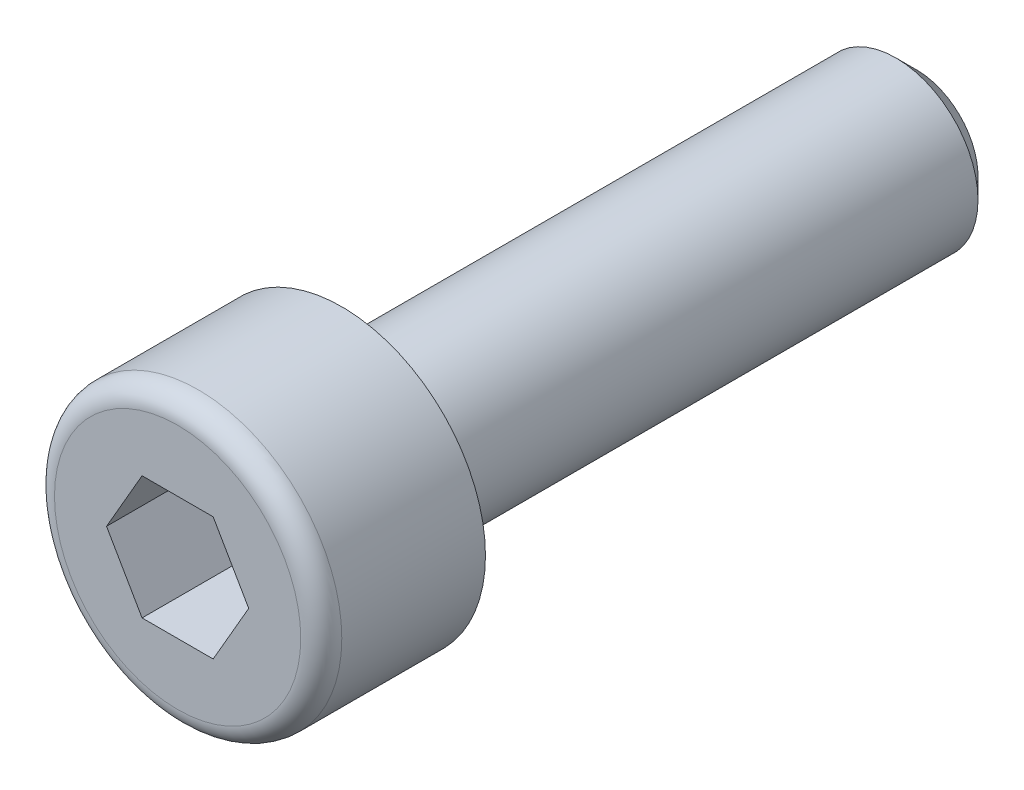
from build123d import *

# Parameters (mm, degrees)
ESQUISSE1_R             = 3.5
BASE_EXTRUSION_DEPTH    = 4
ESQUISSE2_R             = 2
BOSS_EXTRU_1_DEPTH      = 14
CHANFREIN1_SIZE         = 0.5
ENL_V_MAT_EXTRU_1_DEPTH = 3
CONG_1_R                = 0.5


with BuildPart() as part:
    # Esquisse1 → Base-Extrusion (new body)
    with BuildSketch(Plane.XY):
        Circle(ESQUISSE1_R)
    extrude(amount=BASE_EXTRUSION_DEPTH)

    # Esquisse2 → Boss.-Extru.1 (add)
    with BuildSketch(Plane(origin=(0, 0, 0), x_dir=(-1, 0, 0), z_dir=(0, 0, -1))):
        with Locations(Location((0, 0, 0), (0, 0, 180))):
            Circle(ESQUISSE2_R)
    extrude(amount=BOSS_EXTRU_1_DEPTH)

    # Chanfrein1
    chanfrein1_edges = [part.edges().sort_by_distance(p)[0] for p in [
        (-2, 0, -14),
    ]]
    chamfer(chanfrein1_edges, length=CHANFREIN1_SIZE)

    # Esquisse3 → Enl_v. mat.-Extru.1 (cut)
    with BuildSketch(Plane.XY.offset(4)):
        Polygon((1.732050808, 0), (0.866025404, 1.5), (-0.866025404, 1.5), (-1.732050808, 0), (-0.866025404, -1.5), (0.866025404, -1.5), align=None)
    extrude(amount=-ENL_V_MAT_EXTRU_1_DEPTH, mode=Mode.SUBTRACT)

    # Cong_1
    cong_1_edges = [part.edges().sort_by_distance(p)[0] for p in [
        (-3.5, 0, 4),
    ]]
    fillet(cong_1_edges, radius=CONG_1_R)


solid = part.part
